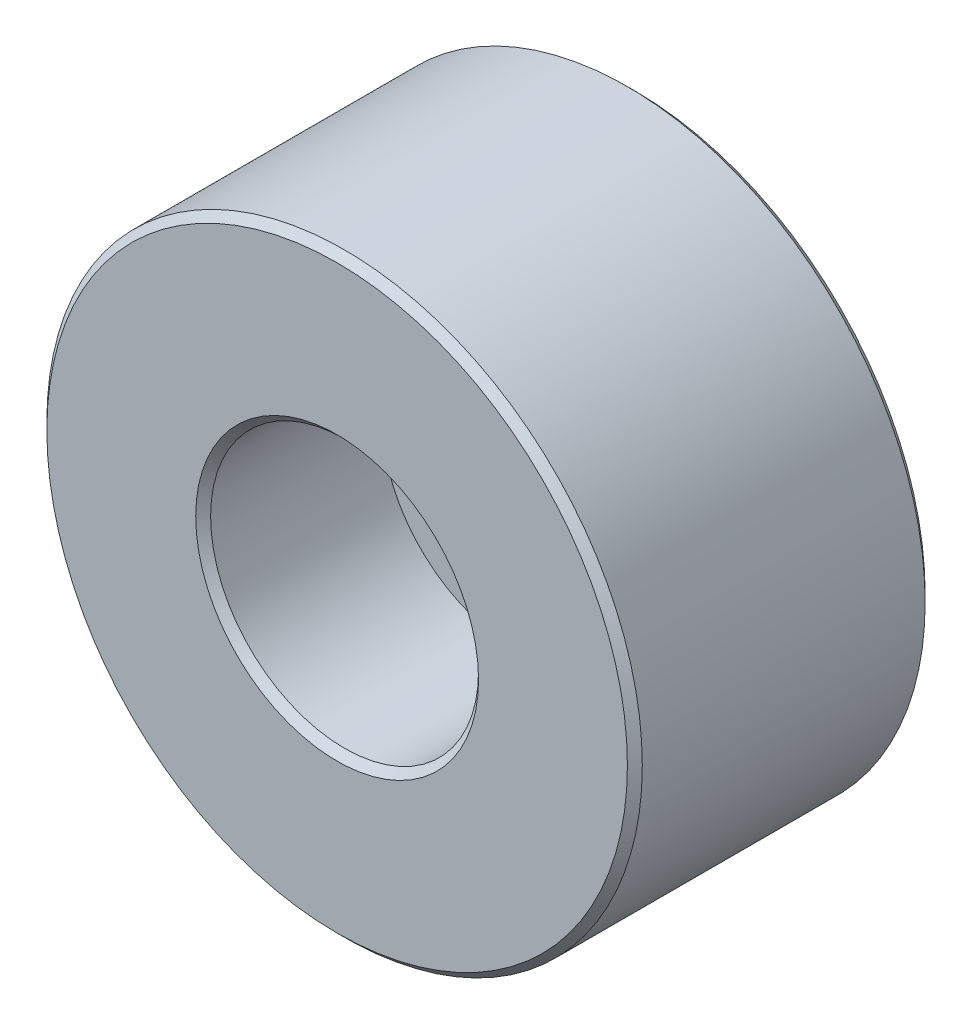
ISO-10303-21;
HEADER;
FILE_DESCRIPTION(('STEP AP214'),'2;1');
FILE_NAME('part.step','',(''),(''),'','','');
FILE_SCHEMA(('AUTOMOTIVE_DESIGN { 1 0 10303 214 1 1 1 1 }'));
ENDSEC;
DATA;
#1=APPLICATION_CONTEXT('core data for automotive mechanical design processes');
#2=APPLICATION_PROTOCOL_DEFINITION('international standard','automotive_design',2000,#1);
#3=PRODUCT_CONTEXT('',#1,'mechanical');
#4=PRODUCT('Part','Part','',(#3));
#5=PRODUCT_RELATED_PRODUCT_CATEGORY('part','',(#4));
#6=PRODUCT_DEFINITION_FORMATION('','',#4);
#7=PRODUCT_DEFINITION_CONTEXT('part definition',#1,'design');
#8=PRODUCT_DEFINITION('design','',#6,#7);
#9=PRODUCT_DEFINITION_SHAPE('','',#8);
#10=(LENGTH_UNIT() NAMED_UNIT(*) SI_UNIT(.MILLI.,.METRE.));
#11=(NAMED_UNIT(*) PLANE_ANGLE_UNIT() SI_UNIT($,.RADIAN.));
#12=(NAMED_UNIT(*) SI_UNIT($,.STERADIAN.) SOLID_ANGLE_UNIT());
#13=UNCERTAINTY_MEASURE_WITH_UNIT(LENGTH_MEASURE(1.E-05),#10,'distance_accuracy_value','');
#14=(GEOMETRIC_REPRESENTATION_CONTEXT(3) GLOBAL_UNCERTAINTY_ASSIGNED_CONTEXT((#13)) GLOBAL_UNIT_ASSIGNED_CONTEXT((#10,
#11,#12)) REPRESENTATION_CONTEXT('',''));
#15=CARTESIAN_POINT('',(0.,0.,0.));
#16=DIRECTION('',(0.,0.,1.));
#17=DIRECTION('',(1.,0.,0.));
#18=AXIS2_PLACEMENT_3D('',#15,#16,#17);
#19=CARTESIAN_POINT('',(0.,-185.034678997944,20.));
#20=DIRECTION('',(0.,0.,-1.));
#21=DIRECTION('',(-1.,0.,0.));
#22=AXIS2_PLACEMENT_3D('',#19,#20,#21);
#23=CYLINDRICAL_SURFACE('',#22,20.);
#24=CARTESIAN_POINT('',(0.,-185.034678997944,19.5));
#25=DIRECTION('',(0.,0.,1.));
#26=DIRECTION('',(1.,0.,0.));
#27=AXIS2_PLACEMENT_3D('',#24,#25,#26);
#28=CIRCLE('',#27,20.);
#29=CARTESIAN_POINT('',(20.,-185.034678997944,19.5));
#30=VERTEX_POINT('',#29);
#31=EDGE_CURVE('E47',#30,#30,#28,.F.);
#32=ORIENTED_EDGE('',*,*,#31,.T.);
#33=EDGE_LOOP('',(#32));
#34=FACE_BOUND('',#33,.T.);
#35=CARTESIAN_POINT('',(0.,-185.034678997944,0.500000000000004));
#36=DIRECTION('',(0.,0.,-1.));
#37=DIRECTION('',(-1.,0.,0.));
#38=AXIS2_PLACEMENT_3D('',#35,#36,#37);
#39=CIRCLE('',#38,20.);
#40=CARTESIAN_POINT('',(-20.,-185.034678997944,0.500000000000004));
#41=VERTEX_POINT('',#40);
#42=EDGE_CURVE('E51',#41,#41,#39,.F.);
#43=ORIENTED_EDGE('',*,*,#42,.T.);
#44=EDGE_LOOP('',(#43));
#45=FACE_BOUND('',#44,.T.);
#46=ADVANCED_FACE('F40',(#34,#45),#23,.T.);
#47=CARTESIAN_POINT('',(20.,-185.034678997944,20.));
#48=DIRECTION('',(0.,0.,1.));
#49=DIRECTION('',(1.,0.,0.));
#50=AXIS2_PLACEMENT_3D('',#47,#48,#49);
#51=PLANE('',#50);
#52=CARTESIAN_POINT('',(0.,-185.034678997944,20.));
#53=DIRECTION('',(0.,0.,1.));
#54=DIRECTION('',(1.,0.,0.));
#55=AXIS2_PLACEMENT_3D('',#52,#53,#54);
#56=CIRCLE('',#55,9.50000000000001);
#57=CARTESIAN_POINT('',(9.50000000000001,-185.034678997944,20.));
#58=VERTEX_POINT('',#57);
#59=EDGE_CURVE('E60',#58,#58,#56,.F.);
#60=ORIENTED_EDGE('',*,*,#59,.T.);
#61=EDGE_LOOP('',(#60));
#62=FACE_BOUND('',#61,.T.);
#63=CARTESIAN_POINT('',(0.,-185.034678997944,20.));
#64=DIRECTION('',(0.,0.,1.));
#65=DIRECTION('',(1.,0.,0.));
#66=AXIS2_PLACEMENT_3D('',#63,#64,#65);
#67=CIRCLE('',#66,19.5);
#68=CARTESIAN_POINT('',(19.5,-185.034678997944,20.));
#69=VERTEX_POINT('',#68);
#70=EDGE_CURVE('E63',#69,#69,#67,.T.);
#71=ORIENTED_EDGE('',*,*,#70,.T.);
#72=EDGE_LOOP('',(#71));
#73=FACE_BOUND('',#72,.T.);
#74=ADVANCED_FACE('F102',(#62,#73),#51,.T.);
#75=CARTESIAN_POINT('',(0.,-185.034678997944,20.));
#76=DIRECTION('',(0.,0.,-1.));
#77=DIRECTION('',(-1.,0.,0.));
#78=AXIS2_PLACEMENT_3D('',#75,#76,#77);
#79=CYLINDRICAL_SURFACE('',#78,9.);
#80=CARTESIAN_POINT('',(0.,-185.034678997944,19.5));
#81=DIRECTION('',(0.,0.,1.));
#82=DIRECTION('',(1.,0.,0.));
#83=AXIS2_PLACEMENT_3D('',#80,#81,#82);
#84=CIRCLE('',#83,9.);
#85=CARTESIAN_POINT('',(9.,-185.034678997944,19.5));
#86=VERTEX_POINT('',#85);
#87=EDGE_CURVE('E55',#86,#86,#84,.T.);
#88=ORIENTED_EDGE('',*,*,#87,.T.);
#89=EDGE_LOOP('',(#88));
#90=FACE_BOUND('',#89,.T.);
#91=CARTESIAN_POINT('',(0.,-185.034678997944,8.));
#92=DIRECTION('',(0.,0.,-1.));
#93=DIRECTION('',(-1.,0.,0.));
#94=AXIS2_PLACEMENT_3D('',#91,#92,#93);
#95=CIRCLE('',#94,9.);
#96=CARTESIAN_POINT('',(-9.,-185.034678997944,8.));
#97=VERTEX_POINT('',#96);
#98=EDGE_CURVE('E72',#97,#97,#95,.T.);
#99=ORIENTED_EDGE('',*,*,#98,.T.);
#100=EDGE_LOOP('',(#99));
#101=FACE_BOUND('',#100,.T.);
#102=ADVANCED_FACE('F107',(#90,#101),#79,.F.);
#103=CARTESIAN_POINT('',(9.,-185.034678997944,8.));
#104=DIRECTION('',(0.,0.,1.));
#105=DIRECTION('',(1.,0.,0.));
#106=AXIS2_PLACEMENT_3D('',#103,#104,#105);
#107=PLANE('',#106);
#108=CARTESIAN_POINT('',(0.,-185.034678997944,8.));
#109=DIRECTION('',(0.,0.,-1.));
#110=DIRECTION('',(-1.,0.,0.));
#111=AXIS2_PLACEMENT_3D('',#108,#109,#110);
#112=CIRCLE('',#111,5.5);
#113=CARTESIAN_POINT('',(-5.5,-185.034678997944,8.));
#114=VERTEX_POINT('',#113);
#115=EDGE_CURVE('E75',#114,#114,#112,.T.);
#116=ORIENTED_EDGE('',*,*,#115,.T.);
#117=EDGE_LOOP('',(#116));
#118=FACE_BOUND('',#117,.T.);
#119=ORIENTED_EDGE('',*,*,#98,.F.);
#120=EDGE_LOOP('',(#119));
#121=FACE_BOUND('',#120,.T.);
#122=ADVANCED_FACE('F176',(#118,#121),#107,.T.);
#123=CARTESIAN_POINT('',(0.,-185.034678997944,20.));
#124=DIRECTION('',(0.,0.,-1.));
#125=DIRECTION('',(-1.,0.,0.));
#126=AXIS2_PLACEMENT_3D('',#123,#124,#125);
#127=CYLINDRICAL_SURFACE('',#126,5.5);
#128=CARTESIAN_POINT('',(0.,-185.034678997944,-6.));
#129=DIRECTION('',(0.,0.,-1.));
#130=DIRECTION('',(-1.,0.,0.));
#131=AXIS2_PLACEMENT_3D('',#128,#129,#130);
#132=CIRCLE('',#131,5.5);
#133=CARTESIAN_POINT('',(-5.5,-185.034678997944,-6.));
#134=VERTEX_POINT('',#133);
#135=EDGE_CURVE('E78',#134,#134,#132,.T.);
#136=ORIENTED_EDGE('',*,*,#135,.T.);
#137=EDGE_LOOP('',(#136));
#138=FACE_BOUND('',#137,.T.);
#139=ORIENTED_EDGE('',*,*,#115,.F.);
#140=EDGE_LOOP('',(#139));
#141=FACE_BOUND('',#140,.T.);
#142=ADVANCED_FACE('F164',(#138,#141),#127,.F.);
#143=CARTESIAN_POINT('',(5.5,-185.034678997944,-6.));
#144=DIRECTION('',(0.,0.,-1.));
#145=DIRECTION('',(-1.,0.,0.));
#146=AXIS2_PLACEMENT_3D('',#143,#144,#145);
#147=PLANE('',#146);
#148=CARTESIAN_POINT('',(0.,-185.034678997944,-6.));
#149=DIRECTION('',(0.,0.,-1.));
#150=DIRECTION('',(-1.,0.,0.));
#151=AXIS2_PLACEMENT_3D('',#148,#149,#150);
#152=CIRCLE('',#151,8.49999999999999);
#153=CARTESIAN_POINT('',(-8.49999999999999,-185.034678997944,-6.));
#154=VERTEX_POINT('',#153);
#155=EDGE_CURVE('E69',#154,#154,#152,.T.);
#156=ORIENTED_EDGE('',*,*,#155,.T.);
#157=EDGE_LOOP('',(#156));
#158=FACE_BOUND('',#157,.T.);
#159=ORIENTED_EDGE('',*,*,#135,.F.);
#160=EDGE_LOOP('',(#159));
#161=FACE_BOUND('',#160,.T.);
#162=ADVANCED_FACE('F98',(#158,#161),#147,.T.);
#163=CARTESIAN_POINT('',(0.,-185.034678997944,20.));
#164=DIRECTION('',(0.,0.,-1.));
#165=DIRECTION('',(-1.,0.,0.));
#166=AXIS2_PLACEMENT_3D('',#163,#164,#165);
#167=CYLINDRICAL_SURFACE('',#166,9.);
#168=CARTESIAN_POINT('',(0.,-185.034678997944,-5.5));
#169=DIRECTION('',(0.,0.,-1.));
#170=DIRECTION('',(-1.,0.,0.));
#171=AXIS2_PLACEMENT_3D('',#168,#169,#170);
#172=CIRCLE('',#171,9.);
#173=CARTESIAN_POINT('',(-9.,-185.034678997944,-5.5));
#174=VERTEX_POINT('',#173);
#175=EDGE_CURVE('E66',#174,#174,#172,.F.);
#176=ORIENTED_EDGE('',*,*,#175,.T.);
#177=EDGE_LOOP('',(#176));
#178=FACE_BOUND('',#177,.T.);
#179=CARTESIAN_POINT('',(0.,-185.034678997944,0.));
#180=DIRECTION('',(0.,0.,-1.));
#181=DIRECTION('',(-1.,0.,0.));
#182=AXIS2_PLACEMENT_3D('',#179,#180,#181);
#183=CIRCLE('',#182,9.);
#184=CARTESIAN_POINT('',(-9.,-185.034678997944,0.));
#185=VERTEX_POINT('',#184);
#186=EDGE_CURVE('E81',#185,#185,#183,.T.);
#187=ORIENTED_EDGE('',*,*,#186,.T.);
#188=EDGE_LOOP('',(#187));
#189=FACE_BOUND('',#188,.T.);
#190=ADVANCED_FACE('F85',(#178,#189),#167,.T.);
#191=CARTESIAN_POINT('',(9.,-185.034678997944,0.));
#192=DIRECTION('',(0.,0.,-1.));
#193=DIRECTION('',(-1.,0.,0.));
#194=AXIS2_PLACEMENT_3D('',#191,#192,#193);
#195=PLANE('',#194);
#196=CARTESIAN_POINT('',(0.,-185.034678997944,0.));
#197=DIRECTION('',(0.,0.,-1.));
#198=DIRECTION('',(-1.,0.,0.));
#199=AXIS2_PLACEMENT_3D('',#196,#197,#198);
#200=CIRCLE('',#199,19.5);
#201=CARTESIAN_POINT('',(-19.5,-185.034678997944,0.));
#202=VERTEX_POINT('',#201);
#203=EDGE_CURVE('E12',#202,#202,#200,.T.);
#204=ORIENTED_EDGE('',*,*,#203,.T.);
#205=EDGE_LOOP('',(#204));
#206=FACE_BOUND('',#205,.T.);
#207=ORIENTED_EDGE('',*,*,#186,.F.);
#208=EDGE_LOOP('',(#207));
#209=FACE_BOUND('',#208,.T.);
#210=ADVANCED_FACE('F87',(#206,#209),#195,.T.);
#211=CARTESIAN_POINT('',(0.,-185.034678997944,-6.));
#212=DIRECTION('',(0.,0.,1.));
#213=DIRECTION('',(1.,0.,0.));
#214=AXIS2_PLACEMENT_3D('',#211,#212,#213);
#215=CONICAL_SURFACE('',#214,8.49999999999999,0.785398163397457);
#216=ORIENTED_EDGE('',*,*,#175,.F.);
#217=EDGE_LOOP('',(#216));
#218=FACE_BOUND('',#217,.T.);
#219=ORIENTED_EDGE('',*,*,#155,.F.);
#220=EDGE_LOOP('',(#219));
#221=FACE_BOUND('',#220,.T.);
#222=ADVANCED_FACE('F89',(#218,#221),#215,.T.);
#223=CARTESIAN_POINT('',(0.,-185.034678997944,20.));
#224=DIRECTION('',(0.,0.,1.));
#225=DIRECTION('',(1.,0.,0.));
#226=AXIS2_PLACEMENT_3D('',#223,#224,#225);
#227=CONICAL_SURFACE('',#226,9.50000000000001,0.785398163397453);
#228=ORIENTED_EDGE('',*,*,#87,.F.);
#229=EDGE_LOOP('',(#228));
#230=FACE_BOUND('',#229,.T.);
#231=ORIENTED_EDGE('',*,*,#59,.F.);
#232=EDGE_LOOP('',(#231));
#233=FACE_BOUND('',#232,.T.);
#234=ADVANCED_FACE('F95',(#230,#233),#227,.F.);
#235=CARTESIAN_POINT('',(0.,-185.034678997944,19.5));
#236=DIRECTION('',(0.,0.,-1.));
#237=DIRECTION('',(-1.,0.,0.));
#238=AXIS2_PLACEMENT_3D('',#235,#236,#237);
#239=CONICAL_SURFACE('',#238,20.,0.785398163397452);
#240=ORIENTED_EDGE('',*,*,#70,.F.);
#241=EDGE_LOOP('',(#240));
#242=FACE_BOUND('',#241,.T.);
#243=ORIENTED_EDGE('',*,*,#31,.F.);
#244=EDGE_LOOP('',(#243));
#245=FACE_BOUND('',#244,.T.);
#246=ADVANCED_FACE('F114',(#242,#245),#239,.T.);
#247=CARTESIAN_POINT('',(0.,-185.034678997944,0.));
#248=DIRECTION('',(0.,0.,1.));
#249=DIRECTION('',(1.,0.,0.));
#250=AXIS2_PLACEMENT_3D('',#247,#248,#249);
#251=CONICAL_SURFACE('',#250,19.5,0.785398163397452);
#252=ORIENTED_EDGE('',*,*,#42,.F.);
#253=EDGE_LOOP('',(#252));
#254=FACE_BOUND('',#253,.T.);
#255=ORIENTED_EDGE('',*,*,#203,.F.);
#256=EDGE_LOOP('',(#255));
#257=FACE_BOUND('',#256,.T.);
#258=ADVANCED_FACE('F42',(#254,#257),#251,.T.);
#259=CLOSED_SHELL('',(#46,#74,#102,#122,#142,#162,#190,#210,#222,#234,#246,#258));
#260=MANIFOLD_SOLID_BREP('B2',#259);
#261=ADVANCED_BREP_SHAPE_REPRESENTATION('',(#18,#260),#14);
#262=SHAPE_DEFINITION_REPRESENTATION(#9,#261);
ENDSEC;
END-ISO-10303-21;
